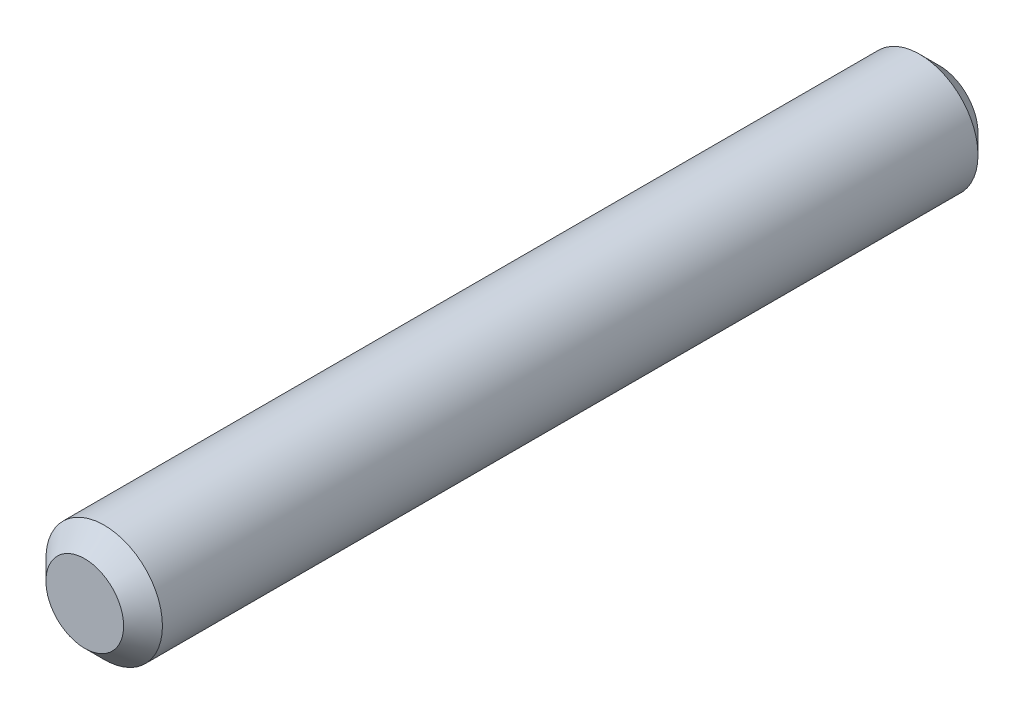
ISO-10303-21;
HEADER;
FILE_DESCRIPTION(('STEP AP214'),'2;1');
FILE_NAME('part.step','',(''),(''),'','','');
FILE_SCHEMA(('AUTOMOTIVE_DESIGN { 1 0 10303 214 1 1 1 1 }'));
ENDSEC;
DATA;
#1=APPLICATION_CONTEXT('core data for automotive mechanical design processes');
#2=APPLICATION_PROTOCOL_DEFINITION('international standard','automotive_design',2000,#1);
#3=PRODUCT_CONTEXT('',#1,'mechanical');
#4=PRODUCT('Part','Part','',(#3));
#5=PRODUCT_RELATED_PRODUCT_CATEGORY('part','',(#4));
#6=PRODUCT_DEFINITION_FORMATION('','',#4);
#7=PRODUCT_DEFINITION_CONTEXT('part definition',#1,'design');
#8=PRODUCT_DEFINITION('design','',#6,#7);
#9=PRODUCT_DEFINITION_SHAPE('','',#8);
#10=(LENGTH_UNIT() NAMED_UNIT(*) SI_UNIT(.MILLI.,.METRE.));
#11=(NAMED_UNIT(*) PLANE_ANGLE_UNIT() SI_UNIT($,.RADIAN.));
#12=(NAMED_UNIT(*) SI_UNIT($,.STERADIAN.) SOLID_ANGLE_UNIT());
#13=UNCERTAINTY_MEASURE_WITH_UNIT(LENGTH_MEASURE(1.E-05),#10,'distance_accuracy_value','');
#14=(GEOMETRIC_REPRESENTATION_CONTEXT(3) GLOBAL_UNCERTAINTY_ASSIGNED_CONTEXT((#13)) GLOBAL_UNIT_ASSIGNED_CONTEXT((#10,
#11,#12)) REPRESENTATION_CONTEXT('',''));
#15=CARTESIAN_POINT('',(0.,0.,0.));
#16=DIRECTION('',(0.,0.,1.));
#17=DIRECTION('',(1.,0.,0.));
#18=AXIS2_PLACEMENT_3D('',#15,#16,#17);
#19=CARTESIAN_POINT('',(0.,0.,5.5));
#20=DIRECTION('',(0.,0.,-1.));
#21=DIRECTION('',(-1.,0.,0.));
#22=AXIS2_PLACEMENT_3D('',#19,#20,#21);
#23=CYLINDRICAL_SURFACE('',#22,0.75);
#24=CARTESIAN_POINT('',(0.,0.,-5.25));
#25=DIRECTION('',(0.,0.,1.));
#26=DIRECTION('',(1.,0.,0.));
#27=AXIS2_PLACEMENT_3D('',#24,#25,#26);
#28=CIRCLE('',#27,0.75);
#29=CARTESIAN_POINT('',(0.75,0.,-5.25));
#30=VERTEX_POINT('',#29);
#31=EDGE_CURVE('E40',#30,#30,#28,.T.);
#32=ORIENTED_EDGE('',*,*,#31,.T.);
#33=EDGE_LOOP('',(#32));
#34=FACE_BOUND('',#33,.T.);
#35=CARTESIAN_POINT('',(0.,0.,5.25));
#36=DIRECTION('',(0.,0.,1.));
#37=DIRECTION('',(1.,0.,0.));
#38=AXIS2_PLACEMENT_3D('',#35,#36,#37);
#39=CIRCLE('',#38,0.75);
#40=CARTESIAN_POINT('',(0.75,0.,5.25));
#41=VERTEX_POINT('',#40);
#42=EDGE_CURVE('E44',#41,#41,#39,.F.);
#43=ORIENTED_EDGE('',*,*,#42,.T.);
#44=EDGE_LOOP('',(#43));
#45=FACE_BOUND('',#44,.T.);
#46=ADVANCED_FACE('F29',(#34,#45),#23,.T.);
#47=CARTESIAN_POINT('',(0.,0.,5.5));
#48=DIRECTION('',(0.,0.,1.));
#49=DIRECTION('',(1.,0.,0.));
#50=AXIS2_PLACEMENT_3D('',#47,#48,#49);
#51=PLANE('',#50);
#52=CARTESIAN_POINT('',(0.,0.,5.5));
#53=DIRECTION('',(0.,0.,1.));
#54=DIRECTION('',(1.,0.,0.));
#55=AXIS2_PLACEMENT_3D('',#52,#53,#54);
#56=CIRCLE('',#55,0.500000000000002);
#57=CARTESIAN_POINT('',(0.500000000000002,0.,5.5));
#58=VERTEX_POINT('',#57);
#59=EDGE_CURVE('E10',#58,#58,#56,.T.);
#60=ORIENTED_EDGE('',*,*,#59,.T.);
#61=EDGE_LOOP('',(#60));
#62=FACE_BOUND('',#61,.T.);
#63=ADVANCED_FACE('F60',(#62),#51,.T.);
#64=CARTESIAN_POINT('',(0.,0.,-5.5));
#65=DIRECTION('',(0.,0.,1.));
#66=DIRECTION('',(1.,0.,0.));
#67=AXIS2_PLACEMENT_3D('',#64,#65,#66);
#68=PLANE('',#67);
#69=CARTESIAN_POINT('',(0.,0.,-5.5));
#70=DIRECTION('',(0.,0.,1.));
#71=DIRECTION('',(1.,0.,0.));
#72=AXIS2_PLACEMENT_3D('',#69,#70,#71);
#73=CIRCLE('',#72,0.499999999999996);
#74=CARTESIAN_POINT('',(0.499999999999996,0.,-5.5));
#75=VERTEX_POINT('',#74);
#76=EDGE_CURVE('E36',#75,#75,#73,.F.);
#77=ORIENTED_EDGE('',*,*,#76,.T.);
#78=EDGE_LOOP('',(#77));
#79=FACE_BOUND('',#78,.T.);
#80=ADVANCED_FACE('F57',(#79),#68,.F.);
#81=CARTESIAN_POINT('',(0.,0.,-5.25));
#82=DIRECTION('',(0.,0.,1.));
#83=DIRECTION('',(1.,0.,0.));
#84=AXIS2_PLACEMENT_3D('',#81,#82,#83);
#85=CONICAL_SURFACE('',#84,0.75,0.785398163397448);
#86=ORIENTED_EDGE('',*,*,#76,.F.);
#87=EDGE_LOOP('',(#86));
#88=FACE_BOUND('',#87,.T.);
#89=ORIENTED_EDGE('',*,*,#31,.F.);
#90=EDGE_LOOP('',(#89));
#91=FACE_BOUND('',#90,.T.);
#92=ADVANCED_FACE('F53',(#88,#91),#85,.T.);
#93=CARTESIAN_POINT('',(0.,0.,5.5));
#94=DIRECTION('',(0.,0.,-1.));
#95=DIRECTION('',(-1.,0.,0.));
#96=AXIS2_PLACEMENT_3D('',#93,#94,#95);
#97=CONICAL_SURFACE('',#96,0.500000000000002,0.785398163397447);
#98=ORIENTED_EDGE('',*,*,#42,.F.);
#99=EDGE_LOOP('',(#98));
#100=FACE_BOUND('',#99,.T.);
#101=ORIENTED_EDGE('',*,*,#59,.F.);
#102=EDGE_LOOP('',(#101));
#103=FACE_BOUND('',#102,.T.);
#104=ADVANCED_FACE('F31',(#100,#103),#97,.T.);
#105=CLOSED_SHELL('',(#46,#63,#80,#92,#104));
#106=MANIFOLD_SOLID_BREP('B2',#105);
#107=ADVANCED_BREP_SHAPE_REPRESENTATION('',(#18,#106),#14);
#108=SHAPE_DEFINITION_REPRESENTATION(#9,#107);
ENDSEC;
END-ISO-10303-21;
